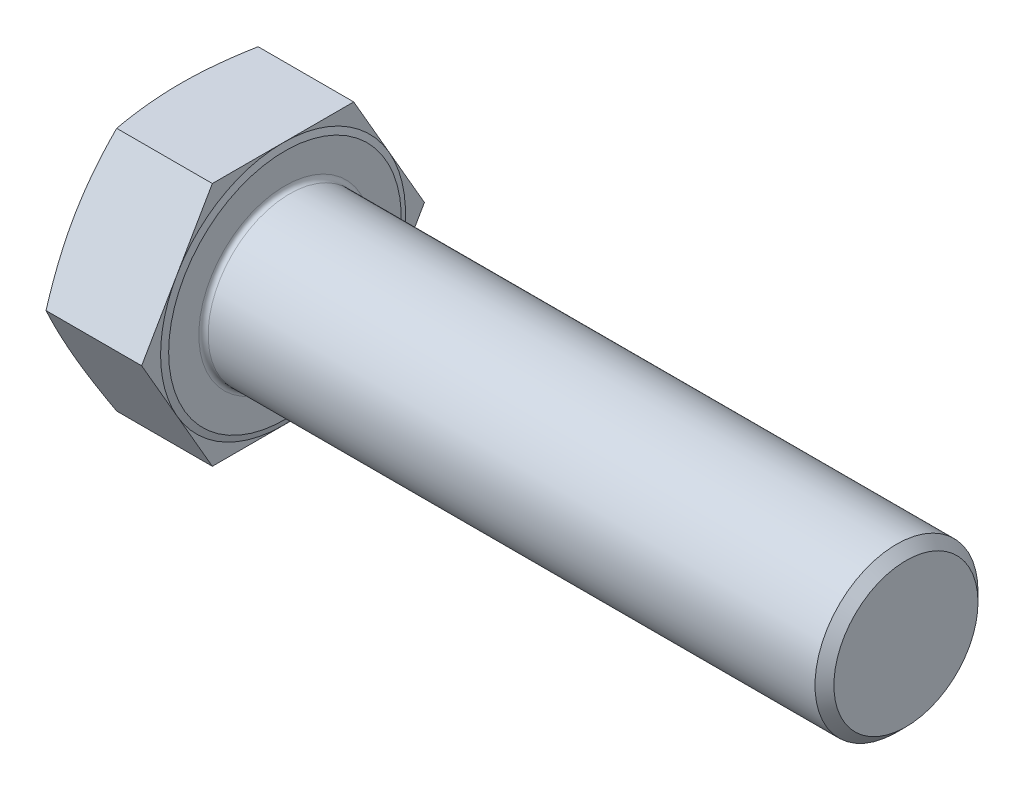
ISO-10303-21;
HEADER;
FILE_DESCRIPTION(('STEP AP214'),'2;1');
FILE_NAME('part.step','',(''),(''),'','','');
FILE_SCHEMA(('AUTOMOTIVE_DESIGN { 1 0 10303 214 1 1 1 1 }'));
ENDSEC;
DATA;
#1=APPLICATION_CONTEXT('core data for automotive mechanical design processes');
#2=APPLICATION_PROTOCOL_DEFINITION('international standard','automotive_design',2000,#1);
#3=PRODUCT_CONTEXT('',#1,'mechanical');
#4=PRODUCT('Part','Part','',(#3));
#5=PRODUCT_RELATED_PRODUCT_CATEGORY('part','',(#4));
#6=PRODUCT_DEFINITION_FORMATION('','',#4);
#7=PRODUCT_DEFINITION_CONTEXT('part definition',#1,'design');
#8=PRODUCT_DEFINITION('design','',#6,#7);
#9=PRODUCT_DEFINITION_SHAPE('','',#8);
#10=(LENGTH_UNIT() NAMED_UNIT(*) SI_UNIT(.MILLI.,.METRE.));
#11=(NAMED_UNIT(*) PLANE_ANGLE_UNIT() SI_UNIT($,.RADIAN.));
#12=(NAMED_UNIT(*) SI_UNIT($,.STERADIAN.) SOLID_ANGLE_UNIT());
#13=UNCERTAINTY_MEASURE_WITH_UNIT(LENGTH_MEASURE(1.E-05),#10,'distance_accuracy_value','');
#14=(GEOMETRIC_REPRESENTATION_CONTEXT(3) GLOBAL_UNCERTAINTY_ASSIGNED_CONTEXT((#13)) GLOBAL_UNIT_ASSIGNED_CONTEXT((#10,
#11,#12)) REPRESENTATION_CONTEXT('',''));
#15=CARTESIAN_POINT('',(0.,0.,0.));
#16=DIRECTION('',(0.,0.,1.));
#17=DIRECTION('',(1.,0.,0.));
#18=AXIS2_PLACEMENT_3D('',#15,#16,#17);
#19=CARTESIAN_POINT('',(26.92,0.,0.));
#20=DIRECTION('',(1.,0.,0.));
#21=DIRECTION('',(0.,0.,-1.));
#22=AXIS2_PLACEMENT_3D('',#19,#20,#21);
#23=PLANE('',#22);
#24=CARTESIAN_POINT('',(26.92,0.,0.));
#25=DIRECTION('',(1.,0.,0.));
#26=DIRECTION('',(0.,0.,-1.));
#27=AXIS2_PLACEMENT_3D('',#24,#25,#26);
#28=CIRCLE('',#27,22.2);
#29=CARTESIAN_POINT('',(26.92,0.,-22.2));
#30=VERTEX_POINT('',#29);
#31=EDGE_CURVE('E188',#30,#30,#28,.F.);
#32=ORIENTED_EDGE('',*,*,#31,.T.);
#33=EDGE_LOOP('',(#32));
#34=FACE_BOUND('',#33,.T.);
#35=CARTESIAN_POINT('',(26.92,0.,0.));
#36=DIRECTION('',(-1.,0.,0.));
#37=DIRECTION('',(0.,0.,1.));
#38=AXIS2_PLACEMENT_3D('',#35,#36,#37);
#39=CIRCLE('',#38,29.975);
#40=CARTESIAN_POINT('',(26.92,0.,29.975));
#41=VERTEX_POINT('',#40);
#42=EDGE_CURVE('E139',#41,#41,#39,.T.);
#43=ORIENTED_EDGE('',*,*,#42,.F.);
#44=EDGE_LOOP('',(#43));
#45=FACE_BOUND('',#44,.T.);
#46=ADVANCED_FACE('F33',(#34,#45),#23,.T.);
#47=CARTESIAN_POINT('',(26.42,0.,-36.4308019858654));
#48=DIRECTION('',(1.,0.,0.));
#49=DIRECTION('',(0.,0.,-1.));
#50=AXIS2_PLACEMENT_3D('',#47,#48,#49);
#51=PLANE('',#50);
#52=DIRECTION('',(0.,-0.866025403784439,0.5));
#53=VECTOR('',#52,1.);
#54=CARTESIAN_POINT('',(26.42,31.55,18.2154009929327));
#55=LINE('',#54,#53);
#56=CARTESIAN_POINT('',(26.42,31.55,18.2154009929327));
#57=VERTEX_POINT('',#56);
#58=CARTESIAN_POINT('',(26.42,15.775,27.323101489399));
#59=VERTEX_POINT('',#58);
#60=EDGE_CURVE('E138',#57,#59,#55,.T.);
#61=ORIENTED_EDGE('',*,*,#60,.T.);
#62=CARTESIAN_POINT('',(26.42,0.,0.));
#63=DIRECTION('',(-1.,0.,0.));
#64=DIRECTION('',(0.,0.,1.));
#65=AXIS2_PLACEMENT_3D('',#62,#63,#64);
#66=CIRCLE('',#65,31.55);
#67=CARTESIAN_POINT('',(26.42,31.55,0.));
#68=VERTEX_POINT('',#67);
#69=EDGE_CURVE('E49',#59,#68,#66,.T.);
#70=ORIENTED_EDGE('',*,*,#69,.T.);
#71=DIRECTION('',(0.,0.,1.));
#72=VECTOR('',#71,1.);
#73=CARTESIAN_POINT('',(26.42,31.55,-18.2154009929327));
#74=LINE('',#73,#72);
#75=EDGE_CURVE('E135',#68,#57,#74,.T.);
#76=ORIENTED_EDGE('',*,*,#75,.T.);
#77=EDGE_LOOP('',(#61,#70,#76));
#78=FACE_BOUND('',#77,.T.);
#79=ADVANCED_FACE('F134',(#78),#51,.T.);
#80=CARTESIAN_POINT('',(26.42,31.55,-18.2154009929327));
#81=VERTEX_POINT('',#80);
#82=EDGE_CURVE('E145',#81,#68,#74,.T.);
#83=ORIENTED_EDGE('',*,*,#82,.T.);
#84=CARTESIAN_POINT('',(26.42,15.775,-27.323101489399));
#85=VERTEX_POINT('',#84);
#86=EDGE_CURVE('E122',#68,#85,#66,.T.);
#87=ORIENTED_EDGE('',*,*,#86,.T.);
#88=DIRECTION('',(0.,0.866025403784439,0.5));
#89=VECTOR('',#88,1.);
#90=CARTESIAN_POINT('',(26.42,0.,-36.4308019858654));
#91=LINE('',#90,#89);
#92=EDGE_CURVE('E151',#85,#81,#91,.T.);
#93=ORIENTED_EDGE('',*,*,#92,.T.);
#94=EDGE_LOOP('',(#83,#87,#93));
#95=FACE_BOUND('',#94,.T.);
#96=ADVANCED_FACE('F150',(#95),#51,.T.);
#97=CARTESIAN_POINT('',(26.42,0.,-36.4308019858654));
#98=VERTEX_POINT('',#97);
#99=EDGE_CURVE('E148',#98,#85,#91,.T.);
#100=ORIENTED_EDGE('',*,*,#99,.T.);
#101=CARTESIAN_POINT('',(26.42,-15.775,-27.323101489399));
#102=VERTEX_POINT('',#101);
#103=EDGE_CURVE('E125',#85,#102,#66,.T.);
#104=ORIENTED_EDGE('',*,*,#103,.T.);
#105=DIRECTION('',(0.,0.866025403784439,-0.5));
#106=VECTOR('',#105,1.);
#107=CARTESIAN_POINT('',(26.42,-31.55,-18.2154009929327));
#108=LINE('',#107,#106);
#109=EDGE_CURVE('E306',#102,#98,#108,.T.);
#110=ORIENTED_EDGE('',*,*,#109,.T.);
#111=EDGE_LOOP('',(#100,#104,#110));
#112=FACE_BOUND('',#111,.T.);
#113=ADVANCED_FACE('F337',(#112),#51,.T.);
#114=CARTESIAN_POINT('',(26.42,-31.55,-18.2154009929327));
#115=VERTEX_POINT('',#114);
#116=EDGE_CURVE('E304',#115,#102,#108,.T.);
#117=ORIENTED_EDGE('',*,*,#116,.T.);
#118=CARTESIAN_POINT('',(26.42,-31.55,0.));
#119=VERTEX_POINT('',#118);
#120=EDGE_CURVE('E338',#102,#119,#66,.T.);
#121=ORIENTED_EDGE('',*,*,#120,.T.);
#122=DIRECTION('',(0.,0.,-1.));
#123=VECTOR('',#122,1.);
#124=CARTESIAN_POINT('',(26.42,-31.55,18.2154009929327));
#125=LINE('',#124,#123);
#126=EDGE_CURVE('E162',#119,#115,#125,.T.);
#127=ORIENTED_EDGE('',*,*,#126,.T.);
#128=EDGE_LOOP('',(#117,#121,#127));
#129=FACE_BOUND('',#128,.T.);
#130=ADVANCED_FACE('F352',(#129),#51,.T.);
#131=CARTESIAN_POINT('',(26.42,-31.55,18.2154009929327));
#132=VERTEX_POINT('',#131);
#133=EDGE_CURVE('E163',#132,#119,#125,.T.);
#134=ORIENTED_EDGE('',*,*,#133,.T.);
#135=CARTESIAN_POINT('',(26.42,-15.775,27.323101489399));
#136=VERTEX_POINT('',#135);
#137=EDGE_CURVE('E339',#119,#136,#66,.T.);
#138=ORIENTED_EDGE('',*,*,#137,.T.);
#139=DIRECTION('',(0.,-0.866025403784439,-0.5));
#140=VECTOR('',#139,1.);
#141=CARTESIAN_POINT('',(26.42,0.,36.4308019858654));
#142=LINE('',#141,#140);
#143=EDGE_CURVE('E158',#136,#132,#142,.T.);
#144=ORIENTED_EDGE('',*,*,#143,.T.);
#145=EDGE_LOOP('',(#134,#138,#144));
#146=FACE_BOUND('',#145,.T.);
#147=ADVANCED_FACE('F347',(#146),#51,.T.);
#148=CARTESIAN_POINT('',(26.42,0.,36.4308019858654));
#149=VERTEX_POINT('',#148);
#150=EDGE_CURVE('E159',#149,#136,#142,.T.);
#151=ORIENTED_EDGE('',*,*,#150,.T.);
#152=EDGE_CURVE('E140',#136,#59,#66,.T.);
#153=ORIENTED_EDGE('',*,*,#152,.T.);
#154=EDGE_CURVE('E153',#59,#149,#55,.T.);
#155=ORIENTED_EDGE('',*,*,#154,.T.);
#156=EDGE_LOOP('',(#151,#153,#155));
#157=FACE_BOUND('',#156,.T.);
#158=ADVANCED_FACE('F213',(#157),#51,.T.);
#159=CARTESIAN_POINT('',(26.42,-31.55,-18.2154009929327));
#160=DIRECTION('',(0.,0.5,0.866025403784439));
#161=DIRECTION('',(0.,-0.866025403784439,0.5));
#162=AXIS2_PLACEMENT_3D('',#159,#160,#161);
#163=PLANE('',#162);
#164=CARTESIAN_POINT('',(1.7765086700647,0.000199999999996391,-36.4309174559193));
#165=CARTESIAN_POINT('',(1.63921700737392,-0.653152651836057,-36.053704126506));
#166=CARTESIAN_POINT('',(1.50810383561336,-1.30750212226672,-35.6759152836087));
#167=CARTESIAN_POINT('',(1.2595842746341,-2.61821067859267,-34.9191773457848));
#168=CARTESIAN_POINT('',(1.1421791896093,-3.27456994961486,-34.540228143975));
#169=CARTESIAN_POINT('',(0.922368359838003,-4.58969160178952,-33.7809423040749));
#170=CARTESIAN_POINT('',(0.81997413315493,-5.24845543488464,-33.400604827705));
#171=CARTESIAN_POINT('',(0.631651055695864,-6.56773486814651,-32.638918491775));
#172=CARTESIAN_POINT('',(0.545721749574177,-7.22825041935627,-32.2575696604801));
#173=CARTESIAN_POINT('',(0.392320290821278,-8.54460325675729,-31.4975729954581));
#174=CARTESIAN_POINT('',(0.324681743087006,-9.20042592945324,-31.1189335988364));
#175=CARTESIAN_POINT('',(0.207877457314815,-10.5133140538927,-30.3609372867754));
#176=CARTESIAN_POINT('',(0.158711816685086,-11.170379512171,-29.9815803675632));
#177=CARTESIAN_POINT('',(0.079708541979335,-12.4851454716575,-29.2224998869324));
#178=CARTESIAN_POINT('',(0.0498638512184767,-13.1428456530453,-28.842776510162));
#179=CARTESIAN_POINT('',(0.0100096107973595,-14.4586972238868,-28.0830692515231));
#180=CARTESIAN_POINT('',(0.,-15.1168486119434,-27.7030853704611));
#181=CARTESIAN_POINT('',(0.,-16.4331513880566,-26.9431176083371));
#182=CARTESIAN_POINT('',(0.0100096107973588,-17.0913027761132,-26.5631337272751));
#183=CARTESIAN_POINT('',(0.0498638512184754,-18.4071543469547,-25.8034264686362));
#184=CARTESIAN_POINT('',(0.0797085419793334,-19.0648545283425,-25.4237030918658));
#185=CARTESIAN_POINT('',(0.158711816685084,-20.3796204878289,-24.664622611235));
#186=CARTESIAN_POINT('',(0.207877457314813,-21.0366859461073,-24.2852656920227));
#187=CARTESIAN_POINT('',(0.324681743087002,-22.3495740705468,-23.5272693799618));
#188=CARTESIAN_POINT('',(0.392320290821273,-23.0053967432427,-23.1486299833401));
#189=CARTESIAN_POINT('',(0.545721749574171,-24.3217495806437,-22.3886333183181));
#190=CARTESIAN_POINT('',(0.631651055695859,-24.9822651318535,-22.0072844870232));
#191=CARTESIAN_POINT('',(0.819974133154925,-26.3015445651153,-21.2455981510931));
#192=CARTESIAN_POINT('',(0.922368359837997,-26.9603083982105,-20.8652606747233));
#193=CARTESIAN_POINT('',(1.14217918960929,-28.2754300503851,-20.1059748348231));
#194=CARTESIAN_POINT('',(1.25958427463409,-28.9317893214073,-19.7270256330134));
#195=CARTESIAN_POINT('',(1.50810383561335,-30.2424978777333,-18.9702876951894));
#196=CARTESIAN_POINT('',(1.63921700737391,-30.8968473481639,-18.5924988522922));
#197=CARTESIAN_POINT('',(1.7765086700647,-31.5502,-18.2152855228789));
#198=B_SPLINE_CURVE_WITH_KNOTS('',3,(#164,#165,#166,#167,#168,#169,#170,#171,#172,#173,#174,
#175,#176,#177,#178,#179,#180,#181,#182,#183,#184,#185,#186,#187,#188,#189,#190,#191,#192,#193,
#194,#195,#196,#197),.UNSPECIFIED.,.F.,.F.,(4,2,2,2,2,2,2,2,2,2,2,2,2,2,2,2,4),(0.,
2.30046481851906,4.60114832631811,6.90358804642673,9.20596408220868,11.4866307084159,
13.7673093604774,16.0471545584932,18.3269927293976,20.606830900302,22.8866760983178,
25.1673547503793,27.4480213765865,29.7503974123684,32.0528371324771,34.3535206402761,
36.6539854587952),.UNSPECIFIED.);
#199=CARTESIAN_POINT('',(1.77646664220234,0.,-36.4308019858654));
#200=VERTEX_POINT('',#199);
#201=CARTESIAN_POINT('',(0.,-15.775,-27.323101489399));
#202=VERTEX_POINT('',#201);
#203=EDGE_CURVE('E321',#200,#202,#198,.T.);
#204=ORIENTED_EDGE('',*,*,#203,.F.);
#205=DIRECTION('',(-1.,0.,0.));
#206=VECTOR('',#205,1.);
#207=CARTESIAN_POINT('',(26.42,0.,-36.4308019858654));
#208=LINE('',#207,#206);
#209=EDGE_CURVE('E178',#98,#200,#208,.T.);
#210=ORIENTED_EDGE('',*,*,#209,.F.);
#211=ORIENTED_EDGE('',*,*,#109,.F.);
#212=ORIENTED_EDGE('',*,*,#116,.F.);
#213=DIRECTION('',(-1.,0.,0.));
#214=VECTOR('',#213,1.);
#215=CARTESIAN_POINT('',(26.42,-31.55,-18.2154009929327));
#216=LINE('',#215,#214);
#217=CARTESIAN_POINT('',(1.77646664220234,-31.55,-18.2154009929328));
#218=VERTEX_POINT('',#217);
#219=EDGE_CURVE('E166',#115,#218,#216,.T.);
#220=ORIENTED_EDGE('',*,*,#219,.T.);
#221=EDGE_CURVE('E246',#202,#218,#198,.T.);
#222=ORIENTED_EDGE('',*,*,#221,.F.);
#223=EDGE_LOOP('',(#204,#210,#211,#212,#220,#222));
#224=FACE_BOUND('',#223,.T.);
#225=ADVANCED_FACE('F35',(#224),#163,.F.);
#226=CARTESIAN_POINT('',(26.42,0.,-36.4308019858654));
#227=DIRECTION('',(0.,-0.5,0.866025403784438));
#228=DIRECTION('',(0.,-0.866025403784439,-0.5));
#229=AXIS2_PLACEMENT_3D('',#226,#227,#228);
#230=PLANE('',#229);
#231=CARTESIAN_POINT('',(1.77650867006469,31.5502,-18.2152855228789));
#232=CARTESIAN_POINT('',(1.63921700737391,30.8968473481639,-18.5924988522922));
#233=CARTESIAN_POINT('',(1.50810383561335,30.2424978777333,-18.9702876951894));
#234=CARTESIAN_POINT('',(1.25958427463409,28.9317893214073,-19.7270256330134));
#235=CARTESIAN_POINT('',(1.14217918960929,28.2754300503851,-20.1059748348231));
#236=CARTESIAN_POINT('',(0.922368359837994,26.9603083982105,-20.8652606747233));
#237=CARTESIAN_POINT('',(0.819974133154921,26.3015445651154,-21.2455981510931));
#238=CARTESIAN_POINT('',(0.631651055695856,24.9822651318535,-22.0072844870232));
#239=CARTESIAN_POINT('',(0.545721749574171,24.3217495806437,-22.3886333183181));
#240=CARTESIAN_POINT('',(0.392320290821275,23.0053967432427,-23.1486299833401));
#241=CARTESIAN_POINT('',(0.324681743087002,22.3495740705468,-23.5272693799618));
#242=CARTESIAN_POINT('',(0.20787745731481,21.0366859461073,-24.2852656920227));
#243=CARTESIAN_POINT('',(0.158711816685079,20.3796204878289,-24.664622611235));
#244=CARTESIAN_POINT('',(0.0797085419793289,19.0648545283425,-25.4237030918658));
#245=CARTESIAN_POINT('',(0.0498638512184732,18.4071543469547,-25.8034264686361));
#246=CARTESIAN_POINT('',(0.0100096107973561,17.0913027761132,-26.563133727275));
#247=CARTESIAN_POINT('',(0.,16.4331513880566,-26.9431176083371));
#248=CARTESIAN_POINT('',(0.,15.1168486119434,-27.7030853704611));
#249=CARTESIAN_POINT('',(0.0100096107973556,14.4586972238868,-28.0830692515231));
#250=CARTESIAN_POINT('',(0.0498638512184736,13.1428456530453,-28.842776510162));
#251=CARTESIAN_POINT('',(0.0797085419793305,12.4851454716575,-29.2224998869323));
#252=CARTESIAN_POINT('',(0.158711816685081,11.170379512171,-29.9815803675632));
#253=CARTESIAN_POINT('',(0.207877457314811,10.5133140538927,-30.3609372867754));
#254=CARTESIAN_POINT('',(0.324681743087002,9.20042592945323,-31.1189335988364));
#255=CARTESIAN_POINT('',(0.392320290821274,8.54460325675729,-31.497572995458));
#256=CARTESIAN_POINT('',(0.545721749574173,7.22825041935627,-32.2575696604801));
#257=CARTESIAN_POINT('',(0.63165105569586,6.56773486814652,-32.6389184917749));
#258=CARTESIAN_POINT('',(0.819974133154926,5.24845543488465,-33.400604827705));
#259=CARTESIAN_POINT('',(0.922368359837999,4.58969160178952,-33.7809423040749));
#260=CARTESIAN_POINT('',(1.14217918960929,3.27456994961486,-34.540228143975));
#261=CARTESIAN_POINT('',(1.2595842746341,2.61821067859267,-34.9191773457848));
#262=CARTESIAN_POINT('',(1.50810383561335,1.30750212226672,-35.6759152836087));
#263=CARTESIAN_POINT('',(1.63921700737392,0.653152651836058,-36.053704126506));
#264=CARTESIAN_POINT('',(1.7765086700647,-0.000199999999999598,-36.4309174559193));
#265=B_SPLINE_CURVE_WITH_KNOTS('',3,(#231,#232,#233,#234,#235,#236,#237,#238,#239,#240,#241,
#242,#243,#244,#245,#246,#247,#248,#249,#250,#251,#252,#253,#254,#255,#256,#257,#258,#259,#260,
#261,#262,#263,#264),.UNSPECIFIED.,.F.,.F.,(4,2,2,2,2,2,2,2,2,2,2,2,2,2,2,2,4),(0.,
2.30046481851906,4.60114832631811,6.90358804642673,9.20596408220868,11.4866307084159,
13.7673093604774,16.0471545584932,18.3269927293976,20.606830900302,22.8866760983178,
25.1673547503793,27.4480213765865,29.7503974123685,32.0528371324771,34.3535206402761,
36.6539854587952),.UNSPECIFIED.);
#266=CARTESIAN_POINT('',(1.77646664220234,31.55,-18.2154009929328));
#267=VERTEX_POINT('',#266);
#268=CARTESIAN_POINT('',(0.,15.775,-27.323101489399));
#269=VERTEX_POINT('',#268);
#270=EDGE_CURVE('E261',#267,#269,#265,.T.);
#271=ORIENTED_EDGE('',*,*,#270,.F.);
#272=DIRECTION('',(-1.,0.,0.));
#273=VECTOR('',#272,1.);
#274=CARTESIAN_POINT('',(26.42,31.55,-18.2154009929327));
#275=LINE('',#274,#273);
#276=EDGE_CURVE('E176',#81,#267,#275,.T.);
#277=ORIENTED_EDGE('',*,*,#276,.F.);
#278=ORIENTED_EDGE('',*,*,#92,.F.);
#279=ORIENTED_EDGE('',*,*,#99,.F.);
#280=ORIENTED_EDGE('',*,*,#209,.T.);
#281=EDGE_CURVE('E257',#269,#200,#265,.T.);
#282=ORIENTED_EDGE('',*,*,#281,.F.);
#283=EDGE_LOOP('',(#271,#277,#278,#279,#280,#282));
#284=FACE_BOUND('',#283,.T.);
#285=ADVANCED_FACE('F267',(#284),#230,.F.);
#286=CARTESIAN_POINT('',(26.42,31.55,-18.2154009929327));
#287=DIRECTION('',(0.,-1.,0.));
#288=DIRECTION('',(0.,0.,-1.));
#289=AXIS2_PLACEMENT_3D('',#286,#287,#288);
#290=PLANE('',#289);
#291=CARTESIAN_POINT('',(9.49273322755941,31.55,-48.2279768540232));
#292=CARTESIAN_POINT('',(9.27535533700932,31.55,-47.514269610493));
#293=CARTESIAN_POINT('',(9.05928889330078,31.55,-46.800161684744));
#294=CARTESIAN_POINT('',(8.63007953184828,31.55,-45.3710634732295));
#295=CARTESIAN_POINT('',(8.41693663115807,31.55,-44.6560731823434));
#296=CARTESIAN_POINT('',(7.99386108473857,31.55,-43.2250819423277));
#297=CARTESIAN_POINT('',(7.78392868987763,31.55,-42.5090809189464));
#298=CARTESIAN_POINT('',(7.36764737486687,31.55,-41.076039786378));
#299=CARTESIAN_POINT('',(7.16129844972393,31.55,-40.3589996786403));
#300=CARTESIAN_POINT('',(6.54743934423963,31.55,-38.2035017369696));
#301=CARTESIAN_POINT('',(6.14590801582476,31.55,-36.7633320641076));
#302=CARTESIAN_POINT('',(5.36259762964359,31.55,-33.8776407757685));
#303=CARTESIAN_POINT('',(4.98081821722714,31.55,-32.4321192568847));
#304=CARTESIAN_POINT('',(4.24647492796,31.55,-29.5526164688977));
#305=CARTESIAN_POINT('',(3.89360887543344,31.55,-28.1187126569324));
#306=CARTESIAN_POINT('',(3.21791822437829,31.55,-25.2437711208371));
#307=CARTESIAN_POINT('',(2.89509413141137,31.55,-23.8027332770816));
#308=CARTESIAN_POINT('',(2.28701543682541,31.55,-20.9131959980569));
#309=CARTESIAN_POINT('',(2.00174801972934,31.55,-19.4646992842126));
#310=CARTESIAN_POINT('',(1.47746597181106,31.55,-16.5593103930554));
#311=CARTESIAN_POINT('',(1.23844979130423,31.55,-15.1024184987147));
#312=CARTESIAN_POINT('',(0.840056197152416,31.55,-12.3442275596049));
#313=CARTESIAN_POINT('',(0.674754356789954,31.55,-11.0437977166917));
#314=CARTESIAN_POINT('',(0.464868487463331,31.55,-9.08909899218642));
#315=CARTESIAN_POINT('',(0.401250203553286,31.55,-8.43684521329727));
#316=CARTESIAN_POINT('',(0.287418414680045,31.55,-7.13117503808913));
#317=CARTESIAN_POINT('',(0.237204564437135,31.55,-6.47775867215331));
#318=CARTESIAN_POINT('',(0.150830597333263,31.55,-5.17044631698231));
#319=CARTESIAN_POINT('',(0.114660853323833,31.55,-4.51655096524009));
#320=CARTESIAN_POINT('',(0.0567933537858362,31.55,-3.20811756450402));
#321=CARTESIAN_POINT('',(0.0350955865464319,31.55,-2.55357951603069));
#322=CARTESIAN_POINT('',(0.0064637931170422,31.55,-1.24418168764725));
#323=CARTESIAN_POINT('',(-0.000470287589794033,31.55,-0.589321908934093));
#324=CARTESIAN_POINT('',(0.000519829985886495,31.55,0.720386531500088));
#325=CARTESIAN_POINT('',(0.00844403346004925,31.55,1.37523519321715));
#326=CARTESIAN_POINT('',(0.0391201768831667,31.55,2.68790470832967));
#327=CARTESIAN_POINT('',(0.0619470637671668,31.55,3.34572380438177));
#328=CARTESIAN_POINT('',(0.122191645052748,31.55,4.66069052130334));
#329=CARTESIAN_POINT('',(0.159609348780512,31.55,5.31783814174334));
#330=CARTESIAN_POINT('',(0.248549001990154,31.55,6.63117728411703));
#331=CARTESIAN_POINT('',(0.300070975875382,31.55,7.28736880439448));
#332=CARTESIAN_POINT('',(0.416580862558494,31.55,8.59856130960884));
#333=CARTESIAN_POINT('',(0.481569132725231,31.55,9.253562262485));
#334=CARTESIAN_POINT('',(0.695749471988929,31.55,11.2175532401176));
#335=CARTESIAN_POINT('',(0.864084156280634,31.55,12.524487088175));
#336=CARTESIAN_POINT('',(1.24501148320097,31.55,15.1317721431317));
#337=CARTESIAN_POINT('',(1.45760436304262,31.55,16.4321233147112));
#338=CARTESIAN_POINT('',(1.93235405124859,31.55,19.0947258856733));
#339=CARTESIAN_POINT('',(2.19653772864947,31.55,20.4566132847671));
#340=CARTESIAN_POINT('',(2.75890764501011,31.55,23.1733910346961));
#341=CARTESIAN_POINT('',(3.05709644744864,31.55,24.5282808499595));
#342=CARTESIAN_POINT('',(3.68121461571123,31.55,27.2320333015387));
#343=CARTESIAN_POINT('',(4.00715203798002,31.55,28.5808940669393));
#344=CARTESIAN_POINT('',(4.68146557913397,31.55,31.2729332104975));
#345=CARTESIAN_POINT('',(5.02984116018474,31.55,32.6161117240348));
#346=CARTESIAN_POINT('',(5.74529589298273,31.55,35.2993081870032));
#347=CARTESIAN_POINT('',(6.11239849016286,31.55,36.6393198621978));
#348=CARTESIAN_POINT('',(6.8615370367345,31.55,39.3151567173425));
#349=CARTESIAN_POINT('',(7.24357304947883,31.55,40.650981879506));
#350=CARTESIAN_POINT('',(8.01984512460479,31.55,43.31883181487));
#351=CARTESIAN_POINT('',(8.41407912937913,31.55,44.6508571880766));
#352=CARTESIAN_POINT('',(9.2126888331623,31.55,47.3118560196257));
#353=CARTESIAN_POINT('',(9.61706451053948,31.55,48.6408294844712));
#354=CARTESIAN_POINT('',(10.4297571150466,31.55,51.2815133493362));
#355=CARTESIAN_POINT('',(10.8379812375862,31.55,52.5932523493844));
#356=CARTESIAN_POINT('',(11.6613832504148,31.55,55.2145439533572));
#357=CARTESIAN_POINT('',(12.0765611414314,31.55,56.5240965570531));
#358=CARTESIAN_POINT('',(12.9128263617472,31.55,59.1413781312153));
#359=CARTESIAN_POINT('',(13.3339139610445,31.55,60.4491070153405));
#360=CARTESIAN_POINT('',(14.1811137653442,31.55,63.0629364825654));
#361=CARTESIAN_POINT('',(14.6072259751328,31.55,64.3690370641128));
#362=CARTESIAN_POINT('',(15.462137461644,31.55,66.974867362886));
#363=CARTESIAN_POINT('',(15.8909203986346,31.55,68.2746024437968));
#364=CARTESIAN_POINT('',(16.7521863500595,31.55,70.8728463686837));
#365=CARTESIAN_POINT('',(17.184669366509,31.55,72.1713552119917));
#366=CARTESIAN_POINT('',(18.0528122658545,31.55,74.7671917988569));
#367=CARTESIAN_POINT('',(18.4884718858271,31.55,76.0645196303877));
#368=CARTESIAN_POINT('',(19.3626101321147,31.55,78.6582218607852));
#369=CARTESIAN_POINT('',(19.8010887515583,31.55,79.9545962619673));
#370=CARTESIAN_POINT('',(20.240781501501,31.55,81.2505577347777));
#371=B_SPLINE_CURVE_WITH_KNOTS('',3,(#291,#292,#293,#294,#295,#296,#297,#298,#299,#300,#301,
#302,#303,#304,#305,#306,#307,#308,#309,#310,#311,#312,#313,#314,#315,#316,#317,#318,#319,#320,
#321,#322,#323,#324,#325,#326,#327,#328,#329,#330,#331,#332,#333,#334,#335,#336,#337,#338,#339,
#340,#341,#342,#343,#344,#345,#346,#347,#348,#349,#350,#351,#352,#353,#354,#355,#356,#357,#358,
#359,#360,#361,#362,#363,#364,#365,#366,#367,#368,#369,#370),.UNSPECIFIED.,.F.,.F.,(4,2,2,2,2,2,
2,2,2,2,2,2,2,2,2,2,2,2,2,2,2,2,2,2,2,2,2,2,2,2,2,2,2,2,2,2,2,2,2,4),(0.,2.23823199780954,
4.47647704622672,6.71489610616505,8.95331204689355,13.4384856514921,17.9235786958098,
22.3533728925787,26.7832416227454,31.2115948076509,35.6397995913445,39.5715182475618,
41.5374489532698,43.5033290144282,45.4678590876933,47.4323875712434,49.3969088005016,
51.361430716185,53.3359092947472,55.3103891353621,57.2848723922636,59.2594080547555,
63.2116176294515,67.1638483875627,71.3251316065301,75.486728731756,79.6495382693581,
83.8122480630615,87.9803038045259,92.1483772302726,96.3157513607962,100.483116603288,
104.604471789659,108.725827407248,112.847371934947,116.968920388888,121.07482378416,
125.180729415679,129.286298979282,133.391858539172),.UNSPECIFIED.);
#372=CARTESIAN_POINT('',(1.77646664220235,31.5500000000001,18.2154009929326));
#373=VERTEX_POINT('',#372);
#374=CARTESIAN_POINT('',(0.,31.55,0.));
#375=VERTEX_POINT('',#374);
#376=EDGE_CURVE('E57',#373,#375,#371,.F.);
#377=ORIENTED_EDGE('',*,*,#376,.F.);
#378=DIRECTION('',(-1.,0.,0.));
#379=VECTOR('',#378,1.);
#380=CARTESIAN_POINT('',(26.42,31.55,18.2154009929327));
#381=LINE('',#380,#379);
#382=EDGE_CURVE('E147',#57,#373,#381,.T.);
#383=ORIENTED_EDGE('',*,*,#382,.F.);
#384=ORIENTED_EDGE('',*,*,#75,.F.);
#385=ORIENTED_EDGE('',*,*,#82,.F.);
#386=ORIENTED_EDGE('',*,*,#276,.T.);
#387=EDGE_CURVE('E262',#375,#267,#371,.F.);
#388=ORIENTED_EDGE('',*,*,#387,.F.);
#389=EDGE_LOOP('',(#377,#383,#384,#385,#386,#388));
#390=FACE_BOUND('',#389,.T.);
#391=ADVANCED_FACE('F143',(#390),#290,.F.);
#392=CARTESIAN_POINT('',(26.42,31.55,18.2154009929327));
#393=DIRECTION('',(0.,-0.5,-0.866025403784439));
#394=DIRECTION('',(0.,0.866025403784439,-0.5));
#395=AXIS2_PLACEMENT_3D('',#392,#393,#394);
#396=PLANE('',#395);
#397=CARTESIAN_POINT('',(1.77650867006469,-0.000199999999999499,36.4309174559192));
#398=CARTESIAN_POINT('',(1.6392170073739,0.653152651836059,36.0537041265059));
#399=CARTESIAN_POINT('',(1.50810383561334,1.30750212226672,35.6759152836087));
#400=CARTESIAN_POINT('',(1.25958427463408,2.61821067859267,34.9191773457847));
#401=CARTESIAN_POINT('',(1.14217918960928,3.27456994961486,34.540228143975));
#402=CARTESIAN_POINT('',(0.922368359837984,4.58969160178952,33.7809423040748));
#403=CARTESIAN_POINT('',(0.81997413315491,5.24845543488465,33.4006048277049));
#404=CARTESIAN_POINT('',(0.631651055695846,6.56773486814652,32.6389184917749));
#405=CARTESIAN_POINT('',(0.54572174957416,7.22825041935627,32.25756966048));
#406=CARTESIAN_POINT('',(0.392320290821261,8.54460325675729,31.497572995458));
#407=CARTESIAN_POINT('',(0.324681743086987,9.20042592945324,31.1189335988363));
#408=CARTESIAN_POINT('',(0.207877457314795,10.5133140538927,30.3609372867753));
#409=CARTESIAN_POINT('',(0.158711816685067,11.1703795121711,29.9815803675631));
#410=CARTESIAN_POINT('',(0.0797085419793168,12.4851454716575,29.2224998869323));
#411=CARTESIAN_POINT('',(0.0498638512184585,13.1428456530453,28.8427765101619));
#412=CARTESIAN_POINT('',(0.0100096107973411,14.4586972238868,28.083069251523));
#413=CARTESIAN_POINT('',(0.,15.1168486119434,27.703085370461));
#414=CARTESIAN_POINT('',(0.,16.4331513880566,26.943117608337));
#415=CARTESIAN_POINT('',(0.0100096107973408,17.0913027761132,26.563133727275));
#416=CARTESIAN_POINT('',(0.0498638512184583,18.4071543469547,25.8034264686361));
#417=CARTESIAN_POINT('',(0.0797085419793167,19.0648545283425,25.4237030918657));
#418=CARTESIAN_POINT('',(0.158711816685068,20.3796204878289,24.6646226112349));
#419=CARTESIAN_POINT('',(0.207877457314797,21.0366859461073,24.2852656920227));
#420=CARTESIAN_POINT('',(0.324681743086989,22.3495740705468,23.5272693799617));
#421=CARTESIAN_POINT('',(0.392320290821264,23.0053967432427,23.14862998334));
#422=CARTESIAN_POINT('',(0.545721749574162,24.3217495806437,22.388633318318));
#423=CARTESIAN_POINT('',(0.631651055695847,24.9822651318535,22.0072844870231));
#424=CARTESIAN_POINT('',(0.819974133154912,26.3015445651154,21.2455981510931));
#425=CARTESIAN_POINT('',(0.922368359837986,26.9603083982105,20.8652606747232));
#426=CARTESIAN_POINT('',(1.14217918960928,28.2754300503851,20.1059748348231));
#427=CARTESIAN_POINT('',(1.25958427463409,28.9317893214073,19.7270256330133));
#428=CARTESIAN_POINT('',(1.50810383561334,30.2424978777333,18.9702876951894));
#429=CARTESIAN_POINT('',(1.63921700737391,30.8968473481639,18.5924988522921));
#430=CARTESIAN_POINT('',(1.77650867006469,31.5502,18.2152855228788));
#431=B_SPLINE_CURVE_WITH_KNOTS('',3,(#397,#398,#399,#400,#401,#402,#403,#404,#405,#406,#407,
#408,#409,#410,#411,#412,#413,#414,#415,#416,#417,#418,#419,#420,#421,#422,#423,#424,#425,#426,
#427,#428,#429,#430),.UNSPECIFIED.,.F.,.F.,(4,2,2,2,2,2,2,2,2,2,2,2,2,2,2,2,4),(0.,
2.30046481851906,4.60114832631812,6.90358804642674,9.20596408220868,11.4866307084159,
13.7673093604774,16.0471545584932,18.3269927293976,20.606830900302,22.8866760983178,
25.1673547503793,27.4480213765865,29.7503974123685,32.0528371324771,34.3535206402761,
36.6539854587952),.UNSPECIFIED.);
#432=CARTESIAN_POINT('',(1.77646664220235,1.00613961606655E-13,36.4308019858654));
#433=VERTEX_POINT('',#432);
#434=CARTESIAN_POINT('',(0.,15.775,27.323101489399));
#435=VERTEX_POINT('',#434);
#436=EDGE_CURVE('E251',#433,#435,#431,.T.);
#437=ORIENTED_EDGE('',*,*,#436,.F.);
#438=DIRECTION('',(-1.,0.,0.));
#439=VECTOR('',#438,1.);
#440=CARTESIAN_POINT('',(26.42,0.,36.4308019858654));
#441=LINE('',#440,#439);
#442=EDGE_CURVE('E172',#149,#433,#441,.T.);
#443=ORIENTED_EDGE('',*,*,#442,.F.);
#444=ORIENTED_EDGE('',*,*,#154,.F.);
#445=ORIENTED_EDGE('',*,*,#60,.F.);
#446=ORIENTED_EDGE('',*,*,#382,.T.);
#447=EDGE_CURVE('E312',#435,#373,#431,.T.);
#448=ORIENTED_EDGE('',*,*,#447,.F.);
#449=EDGE_LOOP('',(#437,#443,#444,#445,#446,#448));
#450=FACE_BOUND('',#449,.T.);
#451=ADVANCED_FACE('F273',(#450),#396,.F.);
#452=CARTESIAN_POINT('',(26.42,0.,36.4308019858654));
#453=DIRECTION('',(0.,0.5,-0.866025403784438));
#454=DIRECTION('',(0.,0.866025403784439,0.5));
#455=AXIS2_PLACEMENT_3D('',#452,#453,#454);
#456=PLANE('',#455);
#457=CARTESIAN_POINT('',(1.77650867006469,-31.5502,18.2152855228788));
#458=CARTESIAN_POINT('',(1.63921700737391,-30.8968473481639,18.5924988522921));
#459=CARTESIAN_POINT('',(1.50810383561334,-30.2424978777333,18.9702876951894));
#460=CARTESIAN_POINT('',(1.25958427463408,-28.9317893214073,19.7270256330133));
#461=CARTESIAN_POINT('',(1.14217918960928,-28.2754300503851,20.1059748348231));
#462=CARTESIAN_POINT('',(0.922368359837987,-26.9603083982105,20.8652606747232));
#463=CARTESIAN_POINT('',(0.819974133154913,-26.3015445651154,21.2455981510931));
#464=CARTESIAN_POINT('',(0.631651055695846,-24.9822651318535,22.0072844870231));
#465=CARTESIAN_POINT('',(0.545721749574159,-24.3217495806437,22.388633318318));
#466=CARTESIAN_POINT('',(0.39232029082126,-23.0053967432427,23.14862998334));
#467=CARTESIAN_POINT('',(0.324681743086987,-22.3495740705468,23.5272693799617));
#468=CARTESIAN_POINT('',(0.207877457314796,-21.0366859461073,24.2852656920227));
#469=CARTESIAN_POINT('',(0.158711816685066,-20.3796204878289,24.6646226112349));
#470=CARTESIAN_POINT('',(0.0797085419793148,-19.0648545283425,25.4237030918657));
#471=CARTESIAN_POINT('',(0.0498638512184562,-18.4071543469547,25.8034264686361));
#472=CARTESIAN_POINT('',(0.0100096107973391,-17.0913027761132,26.563133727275));
#473=CARTESIAN_POINT('',(0.,-16.4331513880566,26.943117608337));
#474=CARTESIAN_POINT('',(0.,-15.1168486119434,27.703085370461));
#475=CARTESIAN_POINT('',(0.0100096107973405,-14.4586972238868,28.083069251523));
#476=CARTESIAN_POINT('',(0.0498638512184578,-13.1428456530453,28.8427765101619));
#477=CARTESIAN_POINT('',(0.0797085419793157,-12.4851454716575,29.2224998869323));
#478=CARTESIAN_POINT('',(0.158711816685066,-11.1703795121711,29.9815803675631));
#479=CARTESIAN_POINT('',(0.207877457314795,-10.5133140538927,30.3609372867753));
#480=CARTESIAN_POINT('',(0.324681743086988,-9.20042592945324,31.1189335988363));
#481=CARTESIAN_POINT('',(0.392320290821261,-8.54460325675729,31.497572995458));
#482=CARTESIAN_POINT('',(0.54572174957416,-7.22825041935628,32.25756966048));
#483=CARTESIAN_POINT('',(0.631651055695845,-6.56773486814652,32.6389184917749));
#484=CARTESIAN_POINT('',(0.81997413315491,-5.24845543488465,33.4006048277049));
#485=CARTESIAN_POINT('',(0.922368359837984,-4.58969160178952,33.7809423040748));
#486=CARTESIAN_POINT('',(1.14217918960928,-3.27456994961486,34.540228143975));
#487=CARTESIAN_POINT('',(1.25958427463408,-2.61821067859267,34.9191773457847));
#488=CARTESIAN_POINT('',(1.50810383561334,-1.30750212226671,35.6759152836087));
#489=CARTESIAN_POINT('',(1.6392170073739,-0.653152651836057,36.0537041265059));
#490=CARTESIAN_POINT('',(1.77650867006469,0.000199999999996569,36.4309174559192));
#491=B_SPLINE_CURVE_WITH_KNOTS('',3,(#457,#458,#459,#460,#461,#462,#463,#464,#465,#466,#467,
#468,#469,#470,#471,#472,#473,#474,#475,#476,#477,#478,#479,#480,#481,#482,#483,#484,#485,#486,
#487,#488,#489,#490),.UNSPECIFIED.,.F.,.F.,(4,2,2,2,2,2,2,2,2,2,2,2,2,2,2,2,4),(0.,
2.30046481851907,4.60114832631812,6.90358804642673,9.20596408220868,11.4866307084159,
13.7673093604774,16.0471545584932,18.3269927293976,20.606830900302,22.8866760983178,
25.1673547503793,27.4480213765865,29.7503974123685,32.0528371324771,34.3535206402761,
36.6539854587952),.UNSPECIFIED.);
#492=CARTESIAN_POINT('',(1.77646664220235,-31.55,18.2154009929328));
#493=VERTEX_POINT('',#492);
#494=CARTESIAN_POINT('',(0.,-15.775,27.323101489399));
#495=VERTEX_POINT('',#494);
#496=EDGE_CURVE('E239',#493,#495,#491,.T.);
#497=ORIENTED_EDGE('',*,*,#496,.F.);
#498=DIRECTION('',(-1.,0.,0.));
#499=VECTOR('',#498,1.);
#500=CARTESIAN_POINT('',(26.42,-31.55,18.2154009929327));
#501=LINE('',#500,#499);
#502=EDGE_CURVE('E169',#132,#493,#501,.T.);
#503=ORIENTED_EDGE('',*,*,#502,.F.);
#504=ORIENTED_EDGE('',*,*,#143,.F.);
#505=ORIENTED_EDGE('',*,*,#150,.F.);
#506=ORIENTED_EDGE('',*,*,#442,.T.);
#507=EDGE_CURVE('E317',#495,#433,#491,.T.);
#508=ORIENTED_EDGE('',*,*,#507,.F.);
#509=EDGE_LOOP('',(#497,#503,#504,#505,#506,#508));
#510=FACE_BOUND('',#509,.T.);
#511=ADVANCED_FACE('F276',(#510),#456,.F.);
#512=CARTESIAN_POINT('',(26.42,-31.55,18.2154009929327));
#513=DIRECTION('',(0.,1.,0.));
#514=DIRECTION('',(0.,0.,1.));
#515=AXIS2_PLACEMENT_3D('',#512,#513,#514);
#516=PLANE('',#515);
#517=CARTESIAN_POINT('',(9.49273322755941,-31.55,-48.2279768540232));
#518=CARTESIAN_POINT('',(9.27535533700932,-31.55,-47.514269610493));
#519=CARTESIAN_POINT('',(9.05928889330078,-31.55,-46.8001616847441));
#520=CARTESIAN_POINT('',(8.63007953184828,-31.55,-45.3710634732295));
#521=CARTESIAN_POINT('',(8.41693663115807,-31.55,-44.6560731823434));
#522=CARTESIAN_POINT('',(7.99386108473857,-31.55,-43.2250819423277));
#523=CARTESIAN_POINT('',(7.78392868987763,-31.55,-42.5090809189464));
#524=CARTESIAN_POINT('',(7.36764737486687,-31.55,-41.076039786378));
#525=CARTESIAN_POINT('',(7.16129844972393,-31.55,-40.3589996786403));
#526=CARTESIAN_POINT('',(6.54743934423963,-31.55,-38.2035017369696));
#527=CARTESIAN_POINT('',(6.14590801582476,-31.55,-36.7633320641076));
#528=CARTESIAN_POINT('',(5.36259762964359,-31.55,-33.8776407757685));
#529=CARTESIAN_POINT('',(4.98081821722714,-31.55,-32.4321192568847));
#530=CARTESIAN_POINT('',(4.24647492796,-31.55,-29.5526164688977));
#531=CARTESIAN_POINT('',(3.89360887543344,-31.55,-28.1187126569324));
#532=CARTESIAN_POINT('',(3.21791822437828,-31.55,-25.2437711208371));
#533=CARTESIAN_POINT('',(2.89509413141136,-31.55,-23.8027332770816));
#534=CARTESIAN_POINT('',(2.28701543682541,-31.55,-20.9131959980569));
#535=CARTESIAN_POINT('',(2.00174801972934,-31.55,-19.4646992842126));
#536=CARTESIAN_POINT('',(1.47746597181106,-31.55,-16.5593103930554));
#537=CARTESIAN_POINT('',(1.23844979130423,-31.55,-15.1024184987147));
#538=CARTESIAN_POINT('',(0.840056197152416,-31.55,-12.3442275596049));
#539=CARTESIAN_POINT('',(0.674754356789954,-31.55,-11.0437977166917));
#540=CARTESIAN_POINT('',(0.464868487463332,-31.55,-9.08909899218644));
#541=CARTESIAN_POINT('',(0.401250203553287,-31.55,-8.43684521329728));
#542=CARTESIAN_POINT('',(0.287418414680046,-31.55,-7.13117503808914));
#543=CARTESIAN_POINT('',(0.237204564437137,-31.55,-6.47775867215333));
#544=CARTESIAN_POINT('',(0.150830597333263,-31.55,-5.17044631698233));
#545=CARTESIAN_POINT('',(0.114660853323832,-31.55,-4.51655096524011));
#546=CARTESIAN_POINT('',(0.0567933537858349,-31.55,-3.20811756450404));
#547=CARTESIAN_POINT('',(0.0350955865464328,-31.55,-2.55357951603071));
#548=CARTESIAN_POINT('',(0.00646379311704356,-31.55,-1.24418168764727));
#549=CARTESIAN_POINT('',(-0.000470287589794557,-31.55,-0.589321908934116));
#550=CARTESIAN_POINT('',(0.000519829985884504,-31.55,0.720386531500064));
#551=CARTESIAN_POINT('',(0.00844403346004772,-31.55,1.37523519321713));
#552=CARTESIAN_POINT('',(0.039120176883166,-31.55,2.68790470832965));
#553=CARTESIAN_POINT('',(0.0619470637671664,-31.55,3.34572380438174));
#554=CARTESIAN_POINT('',(0.122191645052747,-31.55,4.66069052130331));
#555=CARTESIAN_POINT('',(0.159609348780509,-31.55,5.31783814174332));
#556=CARTESIAN_POINT('',(0.24854900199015,-31.55,6.631177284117));
#557=CARTESIAN_POINT('',(0.300070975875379,-31.55,7.28736880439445));
#558=CARTESIAN_POINT('',(0.416580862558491,-31.55,8.59856130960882));
#559=CARTESIAN_POINT('',(0.481569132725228,-31.55,9.25356226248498));
#560=CARTESIAN_POINT('',(0.695749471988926,-31.55,11.2175532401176));
#561=CARTESIAN_POINT('',(0.864084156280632,-31.55,12.524487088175));
#562=CARTESIAN_POINT('',(1.24501148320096,-31.55,15.1317721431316));
#563=CARTESIAN_POINT('',(1.45760436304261,-31.55,16.4321233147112));
#564=CARTESIAN_POINT('',(1.93235405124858,-31.55,19.0947258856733));
#565=CARTESIAN_POINT('',(2.19653772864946,-31.55,20.4566132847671));
#566=CARTESIAN_POINT('',(2.75890764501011,-31.55,23.1733910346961));
#567=CARTESIAN_POINT('',(3.05709644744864,-31.55,24.5282808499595));
#568=CARTESIAN_POINT('',(3.68121461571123,-31.55,27.2320333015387));
#569=CARTESIAN_POINT('',(4.00715203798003,-31.55,28.5808940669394));
#570=CARTESIAN_POINT('',(4.68146557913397,-31.55,31.2729332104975));
#571=CARTESIAN_POINT('',(5.02984116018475,-31.55,32.6161117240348));
#572=CARTESIAN_POINT('',(5.74529589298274,-31.55,35.2993081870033));
#573=CARTESIAN_POINT('',(6.11239849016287,-31.55,36.6393198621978));
#574=CARTESIAN_POINT('',(6.86153703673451,-31.55,39.3151567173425));
#575=CARTESIAN_POINT('',(7.24357304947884,-31.55,40.650981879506));
#576=CARTESIAN_POINT('',(8.01984512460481,-31.55,43.31883181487));
#577=CARTESIAN_POINT('',(8.41407912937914,-31.55,44.6508571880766));
#578=CARTESIAN_POINT('',(9.21268883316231,-31.55,47.3118560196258));
#579=CARTESIAN_POINT('',(9.6170645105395,-31.55,48.6408294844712));
#580=CARTESIAN_POINT('',(10.4297571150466,-31.55,51.2815133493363));
#581=CARTESIAN_POINT('',(10.8379812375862,-31.55,52.5932523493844));
#582=CARTESIAN_POINT('',(11.6613832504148,-31.55,55.2145439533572));
#583=CARTESIAN_POINT('',(12.0765611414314,-31.55,56.5240965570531));
#584=CARTESIAN_POINT('',(12.9128263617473,-31.55,59.1413781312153));
#585=CARTESIAN_POINT('',(13.3339139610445,-31.55,60.4491070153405));
#586=CARTESIAN_POINT('',(14.1811137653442,-31.55,63.0629364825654));
#587=CARTESIAN_POINT('',(14.6072259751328,-31.55,64.3690370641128));
#588=CARTESIAN_POINT('',(15.462137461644,-31.55,66.9748673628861));
#589=CARTESIAN_POINT('',(15.8909203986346,-31.55,68.2746024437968));
#590=CARTESIAN_POINT('',(16.7521863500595,-31.55,70.8728463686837));
#591=CARTESIAN_POINT('',(17.184669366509,-31.55,72.1713552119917));
#592=CARTESIAN_POINT('',(18.0528122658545,-31.55,74.7671917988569));
#593=CARTESIAN_POINT('',(18.4884718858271,-31.55,76.0645196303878));
#594=CARTESIAN_POINT('',(19.3626101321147,-31.55,78.6582218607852));
#595=CARTESIAN_POINT('',(19.8010887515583,-31.55,79.9545962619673));
#596=CARTESIAN_POINT('',(20.240781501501,-31.55,81.2505577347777));
#597=B_SPLINE_CURVE_WITH_KNOTS('',3,(#517,#518,#519,#520,#521,#522,#523,#524,#525,#526,#527,
#528,#529,#530,#531,#532,#533,#534,#535,#536,#537,#538,#539,#540,#541,#542,#543,#544,#545,#546,
#547,#548,#549,#550,#551,#552,#553,#554,#555,#556,#557,#558,#559,#560,#561,#562,#563,#564,#565,
#566,#567,#568,#569,#570,#571,#572,#573,#574,#575,#576,#577,#578,#579,#580,#581,#582,#583,#584,
#585,#586,#587,#588,#589,#590,#591,#592,#593,#594,#595,#596),.UNSPECIFIED.,.F.,.F.,(4,2,2,2,2,2,
2,2,2,2,2,2,2,2,2,2,2,2,2,2,2,2,2,2,2,2,2,2,2,2,2,2,2,2,2,2,2,2,2,4),(0.,2.23823199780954,
4.47647704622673,6.71489610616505,8.95331204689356,13.4384856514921,17.9235786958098,
22.3533728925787,26.7832416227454,31.211594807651,35.6397995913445,39.5715182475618,
41.5374489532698,43.5033290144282,45.4678590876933,47.4323875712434,49.3969088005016,
51.361430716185,53.3359092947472,55.3103891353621,57.2848723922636,59.2594080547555,
63.2116176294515,67.1638483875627,71.3251316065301,75.4867287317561,79.6495382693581,
83.8122480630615,87.980303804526,92.1483772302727,96.3157513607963,100.483116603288,
104.604471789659,108.725827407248,112.847371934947,116.968920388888,121.07482378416,
125.180729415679,129.286298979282,133.391858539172),.UNSPECIFIED.);
#598=CARTESIAN_POINT('',(0.,-31.55,0.));
#599=VERTEX_POINT('',#598);
#600=EDGE_CURVE('E295',#218,#599,#597,.T.);
#601=ORIENTED_EDGE('',*,*,#600,.F.);
#602=ORIENTED_EDGE('',*,*,#219,.F.);
#603=ORIENTED_EDGE('',*,*,#126,.F.);
#604=ORIENTED_EDGE('',*,*,#133,.F.);
#605=ORIENTED_EDGE('',*,*,#502,.T.);
#606=EDGE_CURVE('E229',#599,#493,#597,.T.);
#607=ORIENTED_EDGE('',*,*,#606,.F.);
#608=EDGE_LOOP('',(#601,#602,#603,#604,#605,#607));
#609=FACE_BOUND('',#608,.T.);
#610=ADVANCED_FACE('F280',(#609),#516,.F.);
#611=CARTESIAN_POINT('',(0.,0.,0.));
#612=DIRECTION('',(1.,0.,0.));
#613=DIRECTION('',(0.,0.,-1.));
#614=AXIS2_PLACEMENT_3D('',#611,#612,#613);
#615=CONICAL_SURFACE('',#614,31.55,1.22173047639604);
#616=ORIENTED_EDGE('',*,*,#281,.T.);
#617=ORIENTED_EDGE('',*,*,#203,.T.);
#618=CARTESIAN_POINT('',(0.,0.,0.));
#619=DIRECTION('',(1.,0.,0.));
#620=DIRECTION('',(0.,0.,-1.));
#621=AXIS2_PLACEMENT_3D('',#618,#619,#620);
#622=CIRCLE('',#621,31.55);
#623=EDGE_CURVE('E181',#202,#269,#622,.T.);
#624=ORIENTED_EDGE('',*,*,#623,.T.);
#625=EDGE_LOOP('',(#616,#617,#624));
#626=FACE_BOUND('',#625,.T.);
#627=ADVANCED_FACE('F284',(#626),#615,.T.);
#628=ORIENTED_EDGE('',*,*,#221,.T.);
#629=ORIENTED_EDGE('',*,*,#600,.T.);
#630=EDGE_CURVE('E184',#599,#202,#622,.T.);
#631=ORIENTED_EDGE('',*,*,#630,.T.);
#632=EDGE_LOOP('',(#628,#629,#631));
#633=FACE_BOUND('',#632,.T.);
#634=ADVANCED_FACE('F289',(#633),#615,.T.);
#635=ORIENTED_EDGE('',*,*,#496,.T.);
#636=EDGE_CURVE('E330',#495,#599,#622,.T.);
#637=ORIENTED_EDGE('',*,*,#636,.T.);
#638=ORIENTED_EDGE('',*,*,#606,.T.);
#639=EDGE_LOOP('',(#635,#637,#638));
#640=FACE_BOUND('',#639,.T.);
#641=ADVANCED_FACE('F224',(#640),#615,.T.);
#642=ORIENTED_EDGE('',*,*,#436,.T.);
#643=EDGE_CURVE('E336',#435,#495,#622,.T.);
#644=ORIENTED_EDGE('',*,*,#643,.T.);
#645=ORIENTED_EDGE('',*,*,#507,.T.);
#646=EDGE_LOOP('',(#642,#644,#645));
#647=FACE_BOUND('',#646,.T.);
#648=ADVANCED_FACE('F223',(#647),#615,.T.);
#649=ORIENTED_EDGE('',*,*,#376,.T.);
#650=CARTESIAN_POINT('',(0.,0.,0.));
#651=DIRECTION('',(-1.,0.,0.));
#652=DIRECTION('',(0.,0.,1.));
#653=AXIS2_PLACEMENT_3D('',#650,#651,#652);
#654=CIRCLE('',#653,31.55);
#655=EDGE_CURVE('E335',#435,#375,#654,.T.);
#656=ORIENTED_EDGE('',*,*,#655,.F.);
#657=ORIENTED_EDGE('',*,*,#447,.T.);
#658=EDGE_LOOP('',(#649,#656,#657));
#659=FACE_BOUND('',#658,.T.);
#660=ADVANCED_FACE('F218',(#659),#615,.T.);
#661=ORIENTED_EDGE('',*,*,#387,.T.);
#662=ORIENTED_EDGE('',*,*,#270,.T.);
#663=EDGE_CURVE('E185',#269,#375,#622,.T.);
#664=ORIENTED_EDGE('',*,*,#663,.T.);
#665=EDGE_LOOP('',(#661,#662,#664));
#666=FACE_BOUND('',#665,.T.);
#667=ADVANCED_FACE('F222',(#666),#615,.T.);
#668=CARTESIAN_POINT('',(0.,0.,-36.4308019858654));
#669=DIRECTION('',(1.,0.,0.));
#670=DIRECTION('',(0.,0.,-1.));
#671=AXIS2_PLACEMENT_3D('',#668,#669,#670);
#672=PLANE('',#671);
#673=ORIENTED_EDGE('',*,*,#663,.F.);
#674=ORIENTED_EDGE('',*,*,#623,.F.);
#675=ORIENTED_EDGE('',*,*,#630,.F.);
#676=ORIENTED_EDGE('',*,*,#636,.F.);
#677=ORIENTED_EDGE('',*,*,#643,.F.);
#678=ORIENTED_EDGE('',*,*,#655,.T.);
#679=EDGE_LOOP('',(#673,#674,#675,#676,#677,#678));
#680=FACE_BOUND('',#679,.T.);
#681=ADVANCED_FACE('F225',(#680),#672,.F.);
#682=CARTESIAN_POINT('',(26.42,0.,0.));
#683=DIRECTION('',(-1.,0.,0.));
#684=DIRECTION('',(0.,0.,1.));
#685=AXIS2_PLACEMENT_3D('',#682,#683,#684);
#686=CONICAL_SURFACE('',#685,31.55,1.26339885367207);
#687=ORIENTED_EDGE('',*,*,#42,.T.);
#688=EDGE_LOOP('',(#687));
#689=FACE_BOUND('',#688,.T.);
#690=ORIENTED_EDGE('',*,*,#69,.F.);
#691=ORIENTED_EDGE('',*,*,#152,.F.);
#692=ORIENTED_EDGE('',*,*,#137,.F.);
#693=ORIENTED_EDGE('',*,*,#120,.F.);
#694=ORIENTED_EDGE('',*,*,#103,.F.);
#695=ORIENTED_EDGE('',*,*,#86,.F.);
#696=EDGE_LOOP('',(#690,#691,#692,#693,#694,#695));
#697=FACE_BOUND('',#696,.T.);
#698=ADVANCED_FACE('F123',(#689,#697),#686,.T.);
#699=CARTESIAN_POINT('',(186.92,0.,0.));
#700=DIRECTION('',(-1.,0.,0.));
#701=DIRECTION('',(0.,0.,1.));
#702=AXIS2_PLACEMENT_3D('',#699,#700,#701);
#703=CYLINDRICAL_SURFACE('',#702,21.);
#704=CARTESIAN_POINT('',(184.4845,0.,0.));
#705=DIRECTION('',(1.,0.,0.));
#706=DIRECTION('',(0.,0.,-1.));
#707=AXIS2_PLACEMENT_3D('',#704,#705,#706);
#708=CIRCLE('',#707,21.);
#709=CARTESIAN_POINT('',(184.4845,0.,-21.));
#710=VERTEX_POINT('',#709);
#711=EDGE_CURVE('E12',#710,#710,#708,.F.);
#712=ORIENTED_EDGE('',*,*,#711,.T.);
#713=EDGE_LOOP('',(#712));
#714=FACE_BOUND('',#713,.T.);
#715=CARTESIAN_POINT('',(28.12,0.,0.));
#716=DIRECTION('',(1.,0.,0.));
#717=DIRECTION('',(0.,0.,-1.));
#718=AXIS2_PLACEMENT_3D('',#715,#716,#717);
#719=CIRCLE('',#718,21.);
#720=CARTESIAN_POINT('',(28.12,0.,-21.));
#721=VERTEX_POINT('',#720);
#722=EDGE_CURVE('E129',#721,#721,#719,.T.);
#723=ORIENTED_EDGE('',*,*,#722,.T.);
#724=EDGE_LOOP('',(#723));
#725=FACE_BOUND('',#724,.T.);
#726=ADVANCED_FACE('F454',(#714,#725),#703,.T.);
#727=CARTESIAN_POINT('',(186.92,0.,0.));
#728=DIRECTION('',(1.,0.,0.));
#729=DIRECTION('',(0.,0.,-1.));
#730=AXIS2_PLACEMENT_3D('',#727,#728,#729);
#731=PLANE('',#730);
#732=CARTESIAN_POINT('',(186.92,0.,0.));
#733=DIRECTION('',(1.,0.,0.));
#734=DIRECTION('',(0.,0.,-1.));
#735=AXIS2_PLACEMENT_3D('',#732,#733,#734);
#736=CIRCLE('',#735,18.5645);
#737=CARTESIAN_POINT('',(186.92,0.,-18.5645));
#738=VERTEX_POINT('',#737);
#739=EDGE_CURVE('E42',#738,#738,#736,.T.);
#740=ORIENTED_EDGE('',*,*,#739,.T.);
#741=EDGE_LOOP('',(#740));
#742=FACE_BOUND('',#741,.T.);
#743=ADVANCED_FACE('F193',(#742),#731,.T.);
#744=CARTESIAN_POINT('',(28.12,0.,0.));
#745=DIRECTION('',(1.,0.,0.));
#746=DIRECTION('',(0.,0.,-1.));
#747=AXIS2_PLACEMENT_3D('',#744,#745,#746);
#748=TOROIDAL_SURFACE('',#747,22.2,1.2);
#749=ORIENTED_EDGE('',*,*,#31,.F.);
#750=EDGE_LOOP('',(#749));
#751=FACE_BOUND('',#750,.T.);
#752=ORIENTED_EDGE('',*,*,#722,.F.);
#753=EDGE_LOOP('',(#752));
#754=FACE_BOUND('',#753,.T.);
#755=ADVANCED_FACE('F197',(#751,#754),#748,.F.);
#756=CARTESIAN_POINT('',(186.92,0.,0.));
#757=DIRECTION('',(-1.,0.,0.));
#758=DIRECTION('',(0.,0.,1.));
#759=AXIS2_PLACEMENT_3D('',#756,#757,#758);
#760=CONICAL_SURFACE('',#759,18.5645,0.785398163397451);
#761=ORIENTED_EDGE('',*,*,#711,.F.);
#762=EDGE_LOOP('',(#761));
#763=FACE_BOUND('',#762,.T.);
#764=ORIENTED_EDGE('',*,*,#739,.F.);
#765=EDGE_LOOP('',(#764));
#766=FACE_BOUND('',#765,.T.);
#767=ADVANCED_FACE('F195',(#763,#766),#760,.T.);
#768=CLOSED_SHELL('',(#46,#79,#96,#113,#130,#147,#158,#225,#285,#391,#451,#511,#610,#627,#634,
#641,#648,#660,#667,#681,#698,#726,#743,#755,#767));
#769=MANIFOLD_SOLID_BREP('B2',#768);
#770=ADVANCED_BREP_SHAPE_REPRESENTATION('',(#18,#769),#14);
#771=SHAPE_DEFINITION_REPRESENTATION(#9,#770);
ENDSEC;
END-ISO-10303-21;
